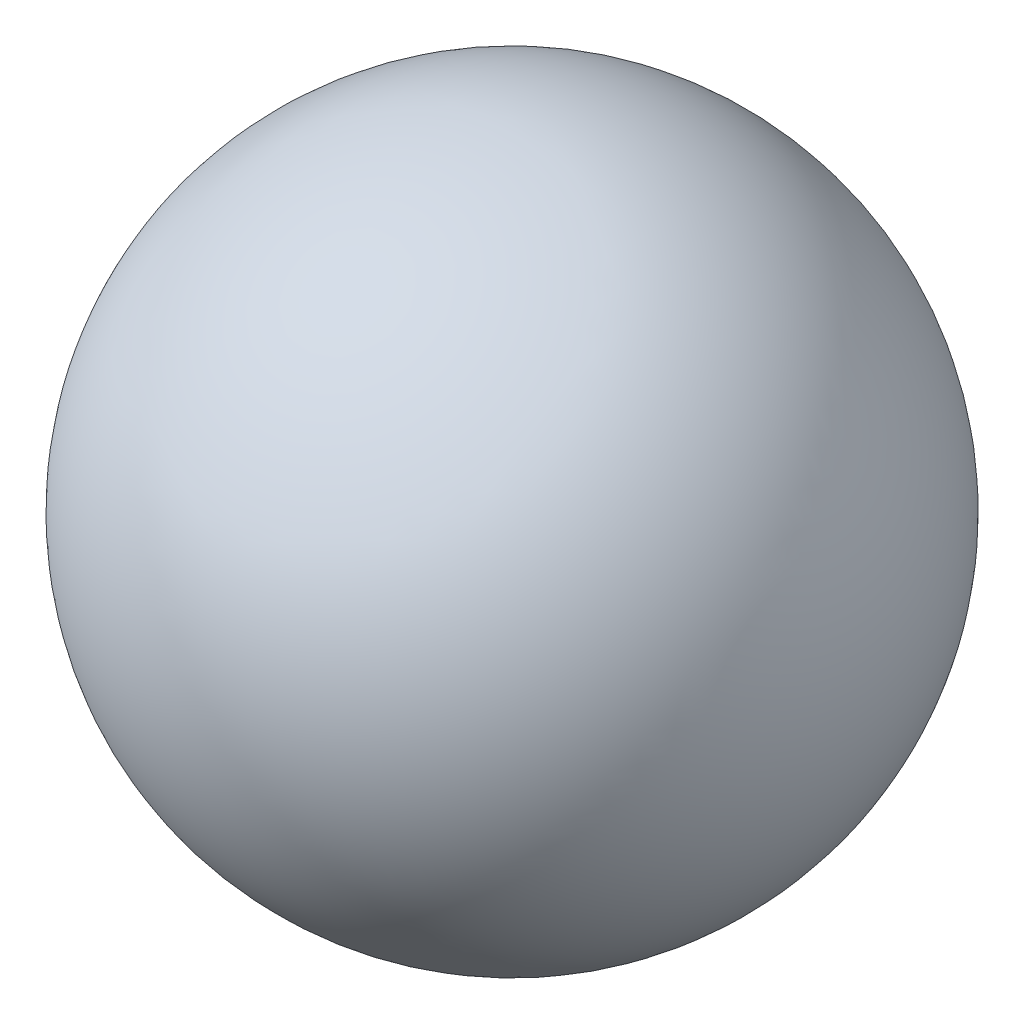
from build123d import *


with BuildPart() as part:
    # Esquisse1 → R_volution1 (revolve)
    with BuildSketch(Plane.XY):
        with BuildLine():
            Line((18, 0), (-18, 0))
            ThreePointArc((-18, 0), (0, -18), (18, 0))
        make_face()
    revolve(axis=Axis((18, 0, 0), (-1, 0, 0)))


solid = part.part
